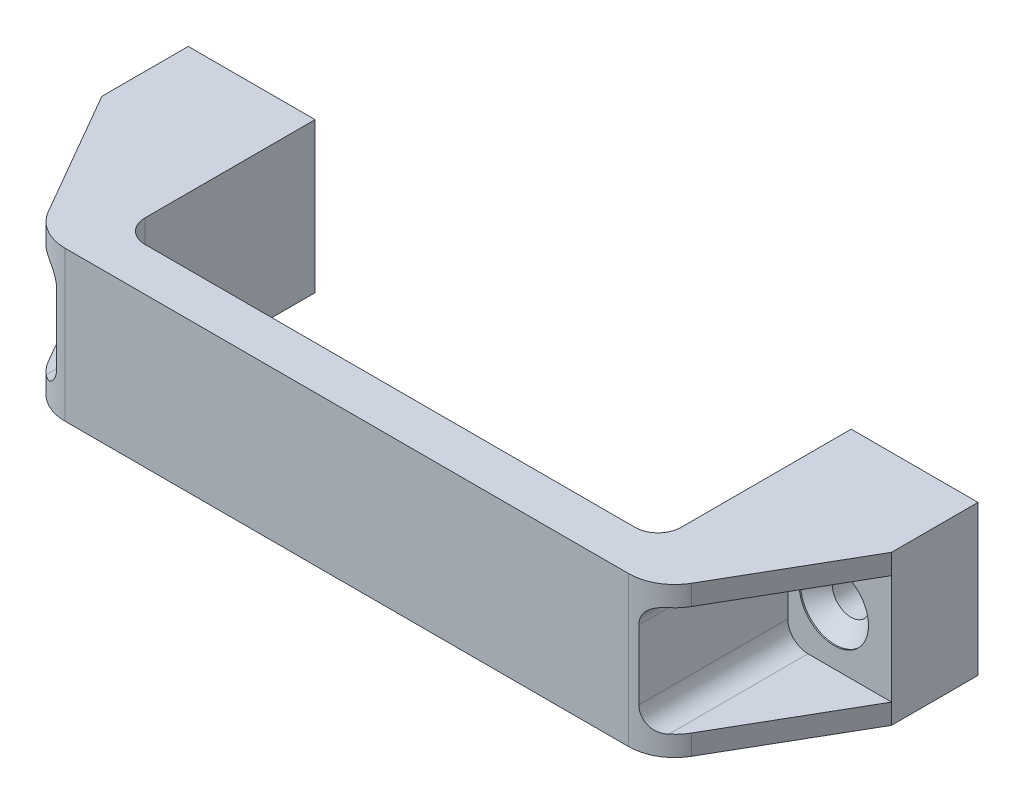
ISO-10303-21;
HEADER;
FILE_DESCRIPTION(('STEP AP214'),'2;1');
FILE_NAME('part.step','',(''),(''),'','','');
FILE_SCHEMA(('AUTOMOTIVE_DESIGN { 1 0 10303 214 1 1 1 1 }'));
ENDSEC;
DATA;
#1=APPLICATION_CONTEXT('core data for automotive mechanical design processes');
#2=APPLICATION_PROTOCOL_DEFINITION('international standard','automotive_design',2000,#1);
#3=PRODUCT_CONTEXT('',#1,'mechanical');
#4=PRODUCT('Part','Part','',(#3));
#5=PRODUCT_RELATED_PRODUCT_CATEGORY('part','',(#4));
#6=PRODUCT_DEFINITION_FORMATION('','',#4);
#7=PRODUCT_DEFINITION_CONTEXT('part definition',#1,'design');
#8=PRODUCT_DEFINITION('design','',#6,#7);
#9=PRODUCT_DEFINITION_SHAPE('','',#8);
#10=(LENGTH_UNIT() NAMED_UNIT(*) SI_UNIT(.MILLI.,.METRE.));
#11=(NAMED_UNIT(*) PLANE_ANGLE_UNIT() SI_UNIT($,.RADIAN.));
#12=(NAMED_UNIT(*) SI_UNIT($,.STERADIAN.) SOLID_ANGLE_UNIT());
#13=UNCERTAINTY_MEASURE_WITH_UNIT(LENGTH_MEASURE(1.E-05),#10,'distance_accuracy_value','');
#14=(GEOMETRIC_REPRESENTATION_CONTEXT(3) GLOBAL_UNCERTAINTY_ASSIGNED_CONTEXT((#13)) GLOBAL_UNIT_ASSIGNED_CONTEXT((#10,
#11,#12)) REPRESENTATION_CONTEXT('',''));
#15=CARTESIAN_POINT('',(0.,0.,0.));
#16=DIRECTION('',(0.,0.,1.));
#17=DIRECTION('',(1.,0.,0.));
#18=AXIS2_PLACEMENT_3D('',#15,#16,#17);
#19=CARTESIAN_POINT('',(0.,0.,14.7749999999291));
#20=DIRECTION('',(0.,0.,1.));
#21=DIRECTION('',(0.,-1.,0.));
#22=AXIS2_PLACEMENT_3D('',#19,#20,#21);
#23=CONICAL_SURFACE('',#22,5.99999999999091,0.785398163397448);
#24=CARTESIAN_POINT('',(0.,0.,12.025));
#25=DIRECTION('',(0.,0.,-1.));
#26=DIRECTION('',(0.,1.,0.));
#27=AXIS2_PLACEMENT_3D('',#24,#25,#26);
#28=CIRCLE('',#27,3.25);
#29=CARTESIAN_POINT('',(0.,3.25,12.025));
#30=VERTEX_POINT('',#29);
#31=EDGE_CURVE('E235',#30,#30,#28,.T.);
#32=ORIENTED_EDGE('',*,*,#31,.T.);
#33=EDGE_LOOP('',(#32));
#34=FACE_BOUND('',#33,.T.);
#35=CARTESIAN_POINT('',(0.,0.,14.775));
#36=DIRECTION('',(0.,0.,-1.));
#37=DIRECTION('',(0.,1.,0.));
#38=AXIS2_PLACEMENT_3D('',#35,#36,#37);
#39=CIRCLE('',#38,6.);
#40=CARTESIAN_POINT('',(0.,6.,14.775));
#41=VERTEX_POINT('',#40);
#42=EDGE_CURVE('E241',#41,#41,#39,.F.);
#43=ORIENTED_EDGE('',*,*,#42,.T.);
#44=EDGE_LOOP('',(#43));
#45=FACE_BOUND('',#44,.T.);
#46=ADVANCED_FACE('F14',(#34,#45),#23,.F.);
#47=CARTESIAN_POINT('',(117.,0.,14.7749999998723));
#48=DIRECTION('',(0.,0.,1.));
#49=DIRECTION('',(0.,-1.,0.));
#50=AXIS2_PLACEMENT_3D('',#47,#48,#49);
#51=CONICAL_SURFACE('',#50,5.9999999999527,0.785398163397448);
#52=CARTESIAN_POINT('',(117.,0.,12.025));
#53=DIRECTION('',(0.,0.,-1.));
#54=DIRECTION('',(0.,1.,0.));
#55=AXIS2_PLACEMENT_3D('',#52,#53,#54);
#56=CIRCLE('',#55,3.25);
#57=CARTESIAN_POINT('',(117.,3.25,12.025));
#58=VERTEX_POINT('',#57);
#59=EDGE_CURVE('E232',#58,#58,#56,.T.);
#60=ORIENTED_EDGE('',*,*,#59,.T.);
#61=EDGE_LOOP('',(#60));
#62=FACE_BOUND('',#61,.T.);
#63=CARTESIAN_POINT('',(117.,0.,14.775));
#64=DIRECTION('',(0.,0.,-1.));
#65=DIRECTION('',(0.,1.,0.));
#66=AXIS2_PLACEMENT_3D('',#63,#64,#65);
#67=CIRCLE('',#66,6.);
#68=CARTESIAN_POINT('',(117.,6.,14.775));
#69=VERTEX_POINT('',#68);
#70=EDGE_CURVE('E238',#69,#69,#67,.F.);
#71=ORIENTED_EDGE('',*,*,#70,.T.);
#72=EDGE_LOOP('',(#71));
#73=FACE_BOUND('',#72,.T.);
#74=ADVANCED_FACE('F347',(#62,#73),#51,.F.);
#75=CARTESIAN_POINT('',(0.,0.,14.8875));
#76=DIRECTION('',(0.,0.,-1.));
#77=DIRECTION('',(0.,1.,0.));
#78=AXIS2_PLACEMENT_3D('',#75,#76,#77);
#79=CYLINDRICAL_SURFACE('',#78,6.);
#80=ORIENTED_EDGE('',*,*,#42,.F.);
#81=EDGE_LOOP('',(#80));
#82=FACE_BOUND('',#81,.T.);
#83=CARTESIAN_POINT('',(0.,0.,14.999));
#84=DIRECTION('',(0.,0.,-1.));
#85=DIRECTION('',(0.,1.,0.));
#86=AXIS2_PLACEMENT_3D('',#83,#84,#85);
#87=CIRCLE('',#86,6.);
#88=CARTESIAN_POINT('',(0.,6.,14.999));
#89=VERTEX_POINT('',#88);
#90=EDGE_CURVE('E17',#89,#89,#87,.T.);
#91=ORIENTED_EDGE('',*,*,#90,.F.);
#92=EDGE_LOOP('',(#91));
#93=FACE_BOUND('',#92,.T.);
#94=ADVANCED_FACE('F344',(#82,#93),#79,.F.);
#95=CARTESIAN_POINT('',(117.,0.,14.8875));
#96=DIRECTION('',(0.,0.,-1.));
#97=DIRECTION('',(0.,1.,0.));
#98=AXIS2_PLACEMENT_3D('',#95,#96,#97);
#99=CYLINDRICAL_SURFACE('',#98,6.);
#100=ORIENTED_EDGE('',*,*,#70,.F.);
#101=EDGE_LOOP('',(#100));
#102=FACE_BOUND('',#101,.T.);
#103=CARTESIAN_POINT('',(117.,0.,14.999));
#104=DIRECTION('',(0.,0.,-1.));
#105=DIRECTION('',(0.,1.,0.));
#106=AXIS2_PLACEMENT_3D('',#103,#104,#105);
#107=CIRCLE('',#106,6.);
#108=CARTESIAN_POINT('',(117.,6.,14.999));
#109=VERTEX_POINT('',#108);
#110=EDGE_CURVE('E206',#109,#109,#107,.T.);
#111=ORIENTED_EDGE('',*,*,#110,.F.);
#112=EDGE_LOOP('',(#111));
#113=FACE_BOUND('',#112,.T.);
#114=ADVANCED_FACE('F340',(#102,#113),#99,.F.);
#115=CARTESIAN_POINT('',(0.,0.,6.0125));
#116=DIRECTION('',(0.,0.,-1.));
#117=DIRECTION('',(0.,1.,0.));
#118=AXIS2_PLACEMENT_3D('',#115,#116,#117);
#119=CYLINDRICAL_SURFACE('',#118,3.25);
#120=CARTESIAN_POINT('',(0.,0.,0.));
#121=DIRECTION('',(0.,0.,-1.));
#122=DIRECTION('',(0.,1.,0.));
#123=AXIS2_PLACEMENT_3D('',#120,#121,#122);
#124=CIRCLE('',#123,3.25);
#125=CARTESIAN_POINT('',(0.,3.25,0.));
#126=VERTEX_POINT('',#125);
#127=EDGE_CURVE('E465',#126,#126,#124,.F.);
#128=ORIENTED_EDGE('',*,*,#127,.F.);
#129=EDGE_LOOP('',(#128));
#130=FACE_BOUND('',#129,.T.);
#131=ORIENTED_EDGE('',*,*,#31,.F.);
#132=EDGE_LOOP('',(#131));
#133=FACE_BOUND('',#132,.T.);
#134=ADVANCED_FACE('F336',(#130,#133),#119,.F.);
#135=CARTESIAN_POINT('',(117.,0.,6.0125));
#136=DIRECTION('',(0.,0.,-1.));
#137=DIRECTION('',(0.,1.,0.));
#138=AXIS2_PLACEMENT_3D('',#135,#136,#137);
#139=CYLINDRICAL_SURFACE('',#138,3.25);
#140=CARTESIAN_POINT('',(117.,0.,0.));
#141=DIRECTION('',(0.,0.,-1.));
#142=DIRECTION('',(0.,1.,0.));
#143=AXIS2_PLACEMENT_3D('',#140,#141,#142);
#144=CIRCLE('',#143,3.25);
#145=CARTESIAN_POINT('',(117.,3.25,0.));
#146=VERTEX_POINT('',#145);
#147=EDGE_CURVE('E451',#146,#146,#144,.F.);
#148=ORIENTED_EDGE('',*,*,#147,.F.);
#149=EDGE_LOOP('',(#148));
#150=FACE_BOUND('',#149,.T.);
#151=ORIENTED_EDGE('',*,*,#59,.F.);
#152=EDGE_LOOP('',(#151));
#153=FACE_BOUND('',#152,.T.);
#154=ADVANCED_FACE('F333',(#150,#153),#139,.F.);
#155=CARTESIAN_POINT('',(58.5,0.,14.999));
#156=DIRECTION('',(0.,0.,1.));
#157=DIRECTION('',(0.,-1.,0.));
#158=AXIS2_PLACEMENT_3D('',#155,#156,#157);
#159=PLANE('',#158);
#160=CARTESIAN_POINT('',(4.5,6.,14.999));
#161=DIRECTION('',(0.,0.,-1.));
#162=DIRECTION('',(0.,1.,0.));
#163=AXIS2_PLACEMENT_3D('',#160,#161,#162);
#164=CIRCLE('',#163,3.5);
#165=CARTESIAN_POINT('',(8.,6.,14.999));
#166=VERTEX_POINT('',#165);
#167=CARTESIAN_POINT('',(4.5,9.5,14.999));
#168=VERTEX_POINT('',#167);
#169=EDGE_CURVE('E162',#166,#168,#164,.F.);
#170=ORIENTED_EDGE('',*,*,#169,.T.);
#171=DIRECTION('',(-1.,0.,0.));
#172=VECTOR('',#171,1.);
#173=CARTESIAN_POINT('',(-12.,9.5,14.999));
#174=LINE('',#173,#172);
#175=CARTESIAN_POINT('',(-10.,9.5,14.999));
#176=VERTEX_POINT('',#175);
#177=EDGE_CURVE('E167',#168,#176,#174,.T.);
#178=ORIENTED_EDGE('',*,*,#177,.T.);
#179=DIRECTION('',(0.,-1.,0.));
#180=VECTOR('',#179,1.);
#181=CARTESIAN_POINT('',(-10.,-13.,14.999));
#182=LINE('',#181,#180);
#183=CARTESIAN_POINT('',(-10.,-9.5,14.999));
#184=VERTEX_POINT('',#183);
#185=EDGE_CURVE('E425',#184,#176,#182,.F.);
#186=ORIENTED_EDGE('',*,*,#185,.F.);
#187=DIRECTION('',(1.,0.,0.));
#188=VECTOR('',#187,1.);
#189=CARTESIAN_POINT('',(4.5,-9.5,14.999));
#190=LINE('',#189,#188);
#191=CARTESIAN_POINT('',(4.5,-9.5,14.999));
#192=VERTEX_POINT('',#191);
#193=EDGE_CURVE('E194',#184,#192,#190,.T.);
#194=ORIENTED_EDGE('',*,*,#193,.T.);
#195=CARTESIAN_POINT('',(4.5,-6.,14.999));
#196=DIRECTION('',(0.,0.,-1.));
#197=DIRECTION('',(0.,1.,0.));
#198=AXIS2_PLACEMENT_3D('',#195,#196,#197);
#199=CIRCLE('',#198,3.5);
#200=CARTESIAN_POINT('',(8.,-6.,14.999));
#201=VERTEX_POINT('',#200);
#202=EDGE_CURVE('E472',#192,#201,#199,.F.);
#203=ORIENTED_EDGE('',*,*,#202,.T.);
#204=DIRECTION('',(0.,1.,0.));
#205=VECTOR('',#204,1.);
#206=CARTESIAN_POINT('',(8.,6.,14.999));
#207=LINE('',#206,#205);
#208=EDGE_CURVE('E160',#201,#166,#207,.T.);
#209=ORIENTED_EDGE('',*,*,#208,.T.);
#210=EDGE_LOOP('',(#170,#178,#186,#194,#203,#209));
#211=FACE_BOUND('',#210,.T.);
#212=ORIENTED_EDGE('',*,*,#90,.T.);
#213=EDGE_LOOP('',(#212));
#214=FACE_BOUND('',#213,.T.);
#215=ADVANCED_FACE('F164',(#211,#214),#159,.T.);
#216=CARTESIAN_POINT('',(58.5,0.,14.999));
#217=DIRECTION('',(0.,0.,1.));
#218=DIRECTION('',(0.,-1.,0.));
#219=AXIS2_PLACEMENT_3D('',#216,#217,#218);
#220=PLANE('',#219);
#221=CARTESIAN_POINT('',(112.5,-6.,14.999));
#222=DIRECTION('',(0.,0.,-1.));
#223=DIRECTION('',(0.,1.,0.));
#224=AXIS2_PLACEMENT_3D('',#221,#222,#223);
#225=CIRCLE('',#224,3.5);
#226=CARTESIAN_POINT('',(109.,-6.,14.999));
#227=VERTEX_POINT('',#226);
#228=CARTESIAN_POINT('',(112.5,-9.5,14.999));
#229=VERTEX_POINT('',#228);
#230=EDGE_CURVE('E397',#227,#229,#225,.F.);
#231=ORIENTED_EDGE('',*,*,#230,.T.);
#232=DIRECTION('',(1.,0.,0.));
#233=VECTOR('',#232,1.);
#234=CARTESIAN_POINT('',(129.,-9.5,14.999));
#235=LINE('',#234,#233);
#236=CARTESIAN_POINT('',(127.,-9.5,14.999));
#237=VERTEX_POINT('',#236);
#238=EDGE_CURVE('E402',#229,#237,#235,.T.);
#239=ORIENTED_EDGE('',*,*,#238,.T.);
#240=DIRECTION('',(0.,1.,0.));
#241=VECTOR('',#240,1.);
#242=CARTESIAN_POINT('',(127.,-13.,14.999));
#243=LINE('',#242,#241);
#244=CARTESIAN_POINT('',(127.,9.5,14.999));
#245=VERTEX_POINT('',#244);
#246=EDGE_CURVE('E440',#245,#237,#243,.F.);
#247=ORIENTED_EDGE('',*,*,#246,.F.);
#248=DIRECTION('',(-1.,0.,0.));
#249=VECTOR('',#248,1.);
#250=CARTESIAN_POINT('',(112.5,9.5,14.999));
#251=LINE('',#250,#249);
#252=CARTESIAN_POINT('',(112.5,9.5,14.999));
#253=VERTEX_POINT('',#252);
#254=EDGE_CURVE('E415',#245,#253,#251,.T.);
#255=ORIENTED_EDGE('',*,*,#254,.T.);
#256=CARTESIAN_POINT('',(112.5,6.,14.999));
#257=DIRECTION('',(0.,0.,-1.));
#258=DIRECTION('',(0.,1.,0.));
#259=AXIS2_PLACEMENT_3D('',#256,#257,#258);
#260=CIRCLE('',#259,3.5);
#261=CARTESIAN_POINT('',(109.,6.,14.999));
#262=VERTEX_POINT('',#261);
#263=EDGE_CURVE('E389',#253,#262,#260,.F.);
#264=ORIENTED_EDGE('',*,*,#263,.T.);
#265=DIRECTION('',(0.,-1.,0.));
#266=VECTOR('',#265,1.);
#267=CARTESIAN_POINT('',(109.,-6.,14.999));
#268=LINE('',#267,#266);
#269=EDGE_CURVE('E228',#262,#227,#268,.T.);
#270=ORIENTED_EDGE('',*,*,#269,.T.);
#271=EDGE_LOOP('',(#231,#239,#247,#255,#264,#270));
#272=FACE_BOUND('',#271,.T.);
#273=ORIENTED_EDGE('',*,*,#110,.T.);
#274=EDGE_LOOP('',(#273));
#275=FACE_BOUND('',#274,.T.);
#276=ADVANCED_FACE('F326',(#272,#275),#220,.T.);
#277=CARTESIAN_POINT('',(4.5,-9.5,14.999));
#278=DIRECTION('',(0.,-1.,0.));
#279=DIRECTION('',(1.,0.,0.));
#280=AXIS2_PLACEMENT_3D('',#277,#278,#279);
#281=PLANE('',#280);
#282=DIRECTION('',(0.,0.,-1.));
#283=VECTOR('',#282,1.);
#284=CARTESIAN_POINT('',(4.5,-9.5,14.999));
#285=LINE('',#284,#283);
#286=CARTESIAN_POINT('',(4.5,-9.5,39.1387321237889));
#287=VERTEX_POINT('',#286);
#288=EDGE_CURVE('E473',#287,#192,#285,.T.);
#289=ORIENTED_EDGE('',*,*,#288,.T.);
#290=ORIENTED_EDGE('',*,*,#193,.F.);
#291=DIRECTION('',(0.,0.,1.));
#292=VECTOR('',#291,1.);
#293=CARTESIAN_POINT('',(-10.,-9.5,15.));
#294=LINE('',#293,#292);
#295=CARTESIAN_POINT('',(-10.,-9.5,15.));
#296=VERTEX_POINT('',#295);
#297=EDGE_CURVE('E203',#296,#184,#294,.F.);
#298=ORIENTED_EDGE('',*,*,#297,.F.);
#299=DIRECTION('',(-0.5,0.,-0.866025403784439));
#300=VECTOR('',#299,1.);
#301=CARTESIAN_POINT('',(2.7017059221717,-9.5,37.));
#302=LINE('',#301,#300);
#303=CARTESIAN_POINT('',(2.70170592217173,-9.5,37.));
#304=VERTEX_POINT('',#303);
#305=EDGE_CURVE('E200',#304,#296,#302,.T.);
#306=ORIENTED_EDGE('',*,*,#305,.F.);
#307=CARTESIAN_POINT('',(9.6299091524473,-9.5,33.));
#308=DIRECTION('',(0.,-1.,0.));
#309=DIRECTION('',(1.,0.,0.));
#310=AXIS2_PLACEMENT_3D('',#307,#308,#309);
#311=CIRCLE('',#310,8.);
#312=EDGE_CURVE('E376',#287,#304,#311,.T.);
#313=ORIENTED_EDGE('',*,*,#312,.F.);
#314=EDGE_LOOP('',(#289,#290,#298,#306,#313));
#315=FACE_BOUND('',#314,.T.);
#316=ADVANCED_FACE('F322',(#315),#281,.F.);
#317=CARTESIAN_POINT('',(2.7017059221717,-13.,37.));
#318=DIRECTION('',(-0.866025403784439,0.,0.5));
#319=DIRECTION('',(-0.5,0.,-0.866025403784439));
#320=AXIS2_PLACEMENT_3D('',#317,#318,#319);
#321=PLANE('',#320);
#322=DIRECTION('',(-0.5,0.,-0.86602540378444));
#323=VECTOR('',#322,1.);
#324=CARTESIAN_POINT('',(2.7017059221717,13.,37.));
#325=LINE('',#324,#323);
#326=CARTESIAN_POINT('',(2.70170592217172,13.,37.));
#327=VERTEX_POINT('',#326);
#328=CARTESIAN_POINT('',(-10.,13.,15.));
#329=VERTEX_POINT('',#328);
#330=EDGE_CURVE('E214',#327,#329,#325,.T.);
#331=ORIENTED_EDGE('',*,*,#330,.T.);
#332=DIRECTION('',(0.,-1.,0.));
#333=VECTOR('',#332,1.);
#334=CARTESIAN_POINT('',(-10.,-13.,15.));
#335=LINE('',#334,#333);
#336=CARTESIAN_POINT('',(-10.,9.5,15.));
#337=VERTEX_POINT('',#336);
#338=EDGE_CURVE('E422',#337,#329,#335,.F.);
#339=ORIENTED_EDGE('',*,*,#338,.F.);
#340=DIRECTION('',(0.5,0.,0.86602540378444));
#341=VECTOR('',#340,1.);
#342=CARTESIAN_POINT('',(-10.,9.5,15.));
#343=LINE('',#342,#341);
#344=CARTESIAN_POINT('',(2.70170592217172,9.5,37.));
#345=VERTEX_POINT('',#344);
#346=EDGE_CURVE('E181',#337,#345,#343,.T.);
#347=ORIENTED_EDGE('',*,*,#346,.T.);
#348=DIRECTION('',(0.,-1.,0.));
#349=VECTOR('',#348,1.);
#350=CARTESIAN_POINT('',(2.70170592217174,-13.,37.));
#351=LINE('',#350,#349);
#352=EDGE_CURVE('E195',#327,#345,#351,.T.);
#353=ORIENTED_EDGE('',*,*,#352,.F.);
#354=EDGE_LOOP('',(#331,#339,#347,#353));
#355=FACE_BOUND('',#354,.T.);
#356=ADVANCED_FACE('F319',(#355),#321,.T.);
#357=CARTESIAN_POINT('',(-12.,9.5,14.999));
#358=DIRECTION('',(0.,1.,0.));
#359=DIRECTION('',(-1.,0.,0.));
#360=AXIS2_PLACEMENT_3D('',#357,#358,#359);
#361=PLANE('',#360);
#362=ORIENTED_EDGE('',*,*,#177,.F.);
#363=DIRECTION('',(0.,0.,-1.));
#364=VECTOR('',#363,1.);
#365=CARTESIAN_POINT('',(4.5,9.5,14.999));
#366=LINE('',#365,#364);
#367=CARTESIAN_POINT('',(4.5,9.5,39.1387321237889));
#368=VERTEX_POINT('',#367);
#369=EDGE_CURVE('E172',#168,#368,#366,.F.);
#370=ORIENTED_EDGE('',*,*,#369,.T.);
#371=CARTESIAN_POINT('',(9.6299091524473,9.5,33.));
#372=DIRECTION('',(0.,-1.,0.));
#373=DIRECTION('',(1.,0.,0.));
#374=AXIS2_PLACEMENT_3D('',#371,#372,#373);
#375=CIRCLE('',#374,8.);
#376=EDGE_CURVE('E198',#345,#368,#375,.F.);
#377=ORIENTED_EDGE('',*,*,#376,.F.);
#378=ORIENTED_EDGE('',*,*,#346,.F.);
#379=DIRECTION('',(0.,0.,1.));
#380=VECTOR('',#379,1.);
#381=CARTESIAN_POINT('',(-10.,9.5,15.));
#382=LINE('',#381,#380);
#383=EDGE_CURVE('E179',#176,#337,#382,.T.);
#384=ORIENTED_EDGE('',*,*,#383,.F.);
#385=EDGE_LOOP('',(#362,#370,#377,#378,#384));
#386=FACE_BOUND('',#385,.T.);
#387=ADVANCED_FACE('F175',(#386),#361,.F.);
#388=CARTESIAN_POINT('',(4.5,6.,14.999));
#389=DIRECTION('',(0.,0.,-1.));
#390=DIRECTION('',(0.,1.,0.));
#391=AXIS2_PLACEMENT_3D('',#388,#389,#390);
#392=CYLINDRICAL_SURFACE('',#391,3.5);
#393=ORIENTED_EDGE('',*,*,#369,.F.);
#394=ORIENTED_EDGE('',*,*,#169,.F.);
#395=DIRECTION('',(0.,0.,1.));
#396=VECTOR('',#395,1.);
#397=CARTESIAN_POINT('',(8.,6.,14.999));
#398=LINE('',#397,#396);
#399=CARTESIAN_POINT('',(8.,6.,40.832202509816));
#400=VERTEX_POINT('',#399);
#401=EDGE_CURVE('E188',#166,#400,#398,.T.);
#402=ORIENTED_EDGE('',*,*,#401,.T.);
#403=CARTESIAN_POINT('',(4.5,9.5,39.1387321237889));
#404=CARTESIAN_POINT('',(4.58708588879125,9.50000495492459,39.2115294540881));
#405=CARTESIAN_POINT('',(4.67577777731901,9.49674876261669,39.2824756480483));
#406=CARTESIAN_POINT('',(4.85582931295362,9.48303589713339,39.420354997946));
#407=CARTESIAN_POINT('',(4.94719168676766,9.4725715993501,39.4872838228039));
#408=CARTESIAN_POINT('',(5.13240901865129,9.44367468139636,39.6170515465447));
#409=CARTESIAN_POINT('',(5.22627567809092,9.42519443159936,39.6798633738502));
#410=CARTESIAN_POINT('',(5.41506152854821,9.37965767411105,39.8005588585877));
#411=CARTESIAN_POINT('',(5.50998035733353,9.35260403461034,39.8584441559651));
#412=CARTESIAN_POINT('',(5.70055149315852,9.28919914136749,39.9693896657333));
#413=CARTESIAN_POINT('',(5.79620412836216,9.25278189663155,40.0224118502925));
#414=CARTESIAN_POINT('',(5.98631653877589,9.17042436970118,40.122906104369));
#415=CARTESIAN_POINT('',(6.08077646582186,9.12448531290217,40.1703788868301));
#416=CARTESIAN_POINT('',(6.2668578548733,9.02314387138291,40.25951067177));
#417=CARTESIAN_POINT('',(6.35848782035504,8.96777394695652,40.3011887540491));
#418=CARTESIAN_POINT('',(6.53784798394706,8.84759941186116,40.3789369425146));
#419=CARTESIAN_POINT('',(6.62557888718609,8.78279651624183,40.4150080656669));
#420=CARTESIAN_POINT('',(6.78392307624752,8.65379473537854,40.4770689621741));
#421=CARTESIAN_POINT('',(6.85521890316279,8.59076815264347,40.5037631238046));
#422=CARTESIAN_POINT('',(6.99312266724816,8.45834899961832,40.5533255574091));
#423=CARTESIAN_POINT('',(7.05972911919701,8.38895442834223,40.5761926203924));
#424=CARTESIAN_POINT('',(7.18749885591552,8.24425165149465,40.6183438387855));
#425=CARTESIAN_POINT('',(7.24865983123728,8.16894096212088,40.6376264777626));
#426=CARTESIAN_POINT('',(7.36484738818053,8.01298882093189,40.6728860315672));
#427=CARTESIAN_POINT('',(7.4198717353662,7.93234544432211,40.6888617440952));
#428=CARTESIAN_POINT('',(7.56970580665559,7.69155092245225,40.7308467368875));
#429=CARTESIAN_POINT('',(7.65577718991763,7.52513673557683,40.752953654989));
#430=CARTESIAN_POINT('',(7.80037290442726,7.18006675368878,40.7883496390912));
#431=CARTESIAN_POINT('',(7.85891375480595,7.00141837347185,40.8016439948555));
#432=CARTESIAN_POINT('',(7.93504985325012,6.68515211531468,40.8184719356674));
#433=CARTESIAN_POINT('',(7.95938635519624,6.54921594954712,40.8236589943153));
#434=CARTESIAN_POINT('',(7.98374137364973,6.34393885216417,40.828805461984));
#435=CARTESIAN_POINT('',(7.98983474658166,6.27531119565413,40.8300819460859));
#436=CARTESIAN_POINT('',(7.99796494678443,6.13779344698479,40.8317791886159));
#437=CARTESIAN_POINT('',(8.00000106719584,6.06890331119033,40.8321997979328));
#438=CARTESIAN_POINT('',(8.,6.,40.832202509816));
#439=B_SPLINE_CURVE_WITH_KNOTS('',3,(#403,#404,#405,#406,#407,#408,#409,#410,#411,#412,#413,
#414,#415,#416,#417,#418,#419,#420,#421,#422,#423,#424,#425,#426,#427,#428,#429,#430,#431,#432,
#433,#434,#435,#436,#437,#438),.UNSPECIFIED.,.F.,.F.,(4,2,2,2,2,2,2,2,2,2,2,2,2,2,2,2,2,4),(0.,
0.340509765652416,0.681380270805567,1.02430453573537,1.36711419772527,1.71240943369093,
2.05766025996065,2.40174592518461,2.74576910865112,3.04189009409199,3.33810444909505,
3.63444383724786,3.93089077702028,4.49401714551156,5.05680518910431,5.47035782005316,
5.67697411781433,5.88362640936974),.UNSPECIFIED.);
#440=EDGE_CURVE('E185',#368,#400,#439,.T.);
#441=ORIENTED_EDGE('',*,*,#440,.F.);
#442=EDGE_LOOP('',(#393,#394,#402,#441));
#443=FACE_BOUND('',#442,.T.);
#444=ADVANCED_FACE('F183',(#443),#392,.F.);
#445=CARTESIAN_POINT('',(8.,6.,14.999));
#446=DIRECTION('',(1.,0.,0.));
#447=DIRECTION('',(0.,1.,0.));
#448=AXIS2_PLACEMENT_3D('',#445,#446,#447);
#449=PLANE('',#448);
#450=ORIENTED_EDGE('',*,*,#401,.F.);
#451=ORIENTED_EDGE('',*,*,#208,.F.);
#452=DIRECTION('',(0.,0.,-1.));
#453=VECTOR('',#452,1.);
#454=CARTESIAN_POINT('',(8.,-6.,14.999));
#455=LINE('',#454,#453);
#456=CARTESIAN_POINT('',(8.,-6.,40.832202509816));
#457=VERTEX_POINT('',#456);
#458=EDGE_CURVE('E471',#201,#457,#455,.F.);
#459=ORIENTED_EDGE('',*,*,#458,.T.);
#460=DIRECTION('',(0.,-1.,0.));
#461=VECTOR('',#460,1.);
#462=CARTESIAN_POINT('',(8.,-13.,40.832202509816));
#463=LINE('',#462,#461);
#464=EDGE_CURVE('E300',#400,#457,#463,.T.);
#465=ORIENTED_EDGE('',*,*,#464,.F.);
#466=EDGE_LOOP('',(#450,#451,#459,#465));
#467=FACE_BOUND('',#466,.T.);
#468=ADVANCED_FACE('F309',(#467),#449,.F.);
#469=CARTESIAN_POINT('',(4.5,-6.,14.999));
#470=DIRECTION('',(0.,0.,-1.));
#471=DIRECTION('',(0.,1.,0.));
#472=AXIS2_PLACEMENT_3D('',#469,#470,#471);
#473=CYLINDRICAL_SURFACE('',#472,3.5);
#474=ORIENTED_EDGE('',*,*,#458,.F.);
#475=ORIENTED_EDGE('',*,*,#202,.F.);
#476=ORIENTED_EDGE('',*,*,#288,.F.);
#477=CARTESIAN_POINT('',(8.,-6.,40.832202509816));
#478=CARTESIAN_POINT('',(8.00001011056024,-6.09578803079,40.8321916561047));
#479=CARTESIAN_POINT('',(7.99606774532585,-6.19157248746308,40.8313838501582));
#480=CARTESIAN_POINT('',(7.98035522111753,-6.38246809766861,40.8280961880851));
#481=CARTESIAN_POINT('',(7.96858508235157,-6.47757925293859,40.825616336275));
#482=CARTESIAN_POINT('',(7.93729814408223,-6.66643860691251,40.8189072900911));
#483=CARTESIAN_POINT('',(7.91778331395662,-6.76018714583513,40.8146785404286));
#484=CARTESIAN_POINT('',(7.87118750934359,-6.94564847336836,40.8043232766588));
#485=CARTESIAN_POINT('',(7.84410670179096,-7.03736130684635,40.7981968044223));
#486=CARTESIAN_POINT('',(7.75175934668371,-7.30861032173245,40.7766715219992));
#487=CARTESIAN_POINT('',(7.67538454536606,-7.48427689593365,40.7581262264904));
#488=CARTESIAN_POINT('',(7.49584954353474,-7.81964044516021,40.7106642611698));
#489=CARTESIAN_POINT('',(7.3926979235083,-7.97934251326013,40.6817509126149));
#490=CARTESIAN_POINT('',(7.16475747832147,-8.27679349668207,40.6116393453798));
#491=CARTESIAN_POINT('',(7.04020113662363,-8.41475054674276,40.5705700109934));
#492=CARTESIAN_POINT('',(6.77397337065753,-8.66695426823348,40.4741953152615));
#493=CARTESIAN_POINT('',(6.63231332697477,-8.78121656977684,40.4188993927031));
#494=CARTESIAN_POINT('',(6.33923739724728,-8.98305156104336,40.2936018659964));
#495=CARTESIAN_POINT('',(6.1879233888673,-9.07086039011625,40.2237404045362));
#496=CARTESIAN_POINT('',(5.8800632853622,-9.22099608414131,40.0688296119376));
#497=CARTESIAN_POINT('',(5.72350688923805,-9.28326915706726,39.9837487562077));
#498=CARTESIAN_POINT('',(5.47564820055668,-9.36265044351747,39.8376548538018));
#499=CARTESIAN_POINT('',(5.3840932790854,-9.38779050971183,39.7812093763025));
#500=CARTESIAN_POINT('',(5.20201322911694,-9.43014657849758,39.6637422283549));
#501=CARTESIAN_POINT('',(5.11148859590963,-9.44735891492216,39.6027184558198));
#502=CARTESIAN_POINT('',(4.93262757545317,-9.4743331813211,39.4766865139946));
#503=CARTESIAN_POINT('',(4.84428468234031,-9.48412076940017,39.4116929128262));
#504=CARTESIAN_POINT('',(4.67012998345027,-9.4969520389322,39.2779527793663));
#505=CARTESIAN_POINT('',(4.58431548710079,-9.50000316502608,39.2092104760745));
#506=CARTESIAN_POINT('',(4.5,-9.5,39.1387321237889));
#507=B_SPLINE_CURVE_WITH_KNOTS('',3,(#477,#478,#479,#480,#481,#482,#483,#484,#485,#486,#487,
#488,#489,#490,#491,#492,#493,#494,#495,#496,#497,#498,#499,#500,#501,#502,#503,#504,#505,#506),
.UNSPECIFIED.,.F.,.F.,(4,2,2,2,2,2,2,2,2,2,2,2,2,2,4),(0.,0.287272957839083,0.574545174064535,
0.861744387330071,1.14893726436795,1.72326329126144,2.29740550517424,2.86566603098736,
3.43355050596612,3.99620429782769,4.56003732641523,4.89106323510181,5.22224207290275,
5.55227115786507,5.88193533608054),.UNSPECIFIED.);
#508=EDGE_CURVE('E291',#457,#287,#507,.T.);
#509=ORIENTED_EDGE('',*,*,#508,.F.);
#510=EDGE_LOOP('',(#474,#475,#476,#509));
#511=FACE_BOUND('',#510,.T.);
#512=ADVANCED_FACE('F303',(#511),#473,.F.);
#513=CARTESIAN_POINT('',(-10.,-13.,0.));
#514=DIRECTION('',(0.,0.,-1.));
#515=DIRECTION('',(0.,1.,0.));
#516=AXIS2_PLACEMENT_3D('',#513,#514,#515);
#517=PLANE('',#516);
#518=DIRECTION('',(1.,0.,0.));
#519=VECTOR('',#518,1.);
#520=CARTESIAN_POINT('',(58.5,-13.,0.));
#521=LINE('',#520,#519);
#522=CARTESIAN_POINT('',(-10.,-13.,0.));
#523=VERTEX_POINT('',#522);
#524=CARTESIAN_POINT('',(12.,-13.,0.));
#525=VERTEX_POINT('',#524);
#526=EDGE_CURVE('E299',#523,#525,#521,.T.);
#527=ORIENTED_EDGE('',*,*,#526,.F.);
#528=DIRECTION('',(0.,-1.,0.));
#529=VECTOR('',#528,1.);
#530=CARTESIAN_POINT('',(-10.,-13.,0.));
#531=LINE('',#530,#529);
#532=CARTESIAN_POINT('',(-10.,13.,0.));
#533=VERTEX_POINT('',#532);
#534=EDGE_CURVE('E421',#533,#523,#531,.T.);
#535=ORIENTED_EDGE('',*,*,#534,.F.);
#536=DIRECTION('',(1.,0.,0.));
#537=VECTOR('',#536,1.);
#538=CARTESIAN_POINT('',(58.5,13.,0.));
#539=LINE('',#538,#537);
#540=CARTESIAN_POINT('',(12.,13.,0.));
#541=VERTEX_POINT('',#540);
#542=EDGE_CURVE('E207',#533,#541,#539,.T.);
#543=ORIENTED_EDGE('',*,*,#542,.T.);
#544=DIRECTION('',(0.,1.,0.));
#545=VECTOR('',#544,1.);
#546=CARTESIAN_POINT('',(12.,-13.,0.));
#547=LINE('',#546,#545);
#548=EDGE_CURVE('E462',#525,#541,#547,.T.);
#549=ORIENTED_EDGE('',*,*,#548,.F.);
#550=EDGE_LOOP('',(#527,#535,#543,#549));
#551=FACE_BOUND('',#550,.T.);
#552=ORIENTED_EDGE('',*,*,#127,.T.);
#553=EDGE_LOOP('',(#552));
#554=FACE_BOUND('',#553,.T.);
#555=ADVANCED_FACE('F308',(#551,#554),#517,.T.);
#556=CARTESIAN_POINT('',(12.,-13.,0.));
#557=DIRECTION('',(1.,0.,0.));
#558=DIRECTION('',(0.,1.,0.));
#559=AXIS2_PLACEMENT_3D('',#556,#557,#558);
#560=PLANE('',#559);
#561=DIRECTION('',(0.,0.,1.));
#562=VECTOR('',#561,1.);
#563=CARTESIAN_POINT('',(12.,-13.,0.));
#564=LINE('',#563,#562);
#565=CARTESIAN_POINT('',(12.,-13.,29.5));
#566=VERTEX_POINT('',#565);
#567=EDGE_CURVE('E468',#525,#566,#564,.T.);
#568=ORIENTED_EDGE('',*,*,#567,.F.);
#569=ORIENTED_EDGE('',*,*,#548,.T.);
#570=DIRECTION('',(0.,0.,1.));
#571=VECTOR('',#570,1.);
#572=CARTESIAN_POINT('',(12.,13.,0.));
#573=LINE('',#572,#571);
#574=CARTESIAN_POINT('',(12.,13.,29.5));
#575=VERTEX_POINT('',#574);
#576=EDGE_CURVE('E210',#541,#575,#573,.T.);
#577=ORIENTED_EDGE('',*,*,#576,.T.);
#578=DIRECTION('',(0.,-1.,0.));
#579=VECTOR('',#578,1.);
#580=CARTESIAN_POINT('',(12.,-13.,29.5));
#581=LINE('',#580,#579);
#582=EDGE_CURVE('E460',#575,#566,#581,.T.);
#583=ORIENTED_EDGE('',*,*,#582,.T.);
#584=EDGE_LOOP('',(#568,#569,#577,#583));
#585=FACE_BOUND('',#584,.T.);
#586=ADVANCED_FACE('F513',(#585),#560,.T.);
#587=CARTESIAN_POINT('',(16.,-13.,29.5));
#588=DIRECTION('',(0.,-1.,0.));
#589=DIRECTION('',(1.,0.,0.));
#590=AXIS2_PLACEMENT_3D('',#587,#588,#589);
#591=CYLINDRICAL_SURFACE('',#590,4.);
#592=DIRECTION('',(0.,1.,0.));
#593=VECTOR('',#592,1.);
#594=CARTESIAN_POINT('',(16.,-13.,33.5));
#595=LINE('',#594,#593);
#596=CARTESIAN_POINT('',(16.,-13.,33.5));
#597=VERTEX_POINT('',#596);
#598=CARTESIAN_POINT('',(16.,13.,33.5));
#599=VERTEX_POINT('',#598);
#600=EDGE_CURVE('E457',#597,#599,#595,.T.);
#601=ORIENTED_EDGE('',*,*,#600,.F.);
#602=CARTESIAN_POINT('',(16.,-13.,29.5));
#603=DIRECTION('',(0.,-1.,0.));
#604=DIRECTION('',(1.,0.,0.));
#605=AXIS2_PLACEMENT_3D('',#602,#603,#604);
#606=CIRCLE('',#605,4.);
#607=EDGE_CURVE('E301',#566,#597,#606,.F.);
#608=ORIENTED_EDGE('',*,*,#607,.F.);
#609=ORIENTED_EDGE('',*,*,#582,.F.);
#610=CARTESIAN_POINT('',(16.,13.,29.5));
#611=DIRECTION('',(0.,-1.,0.));
#612=DIRECTION('',(1.,0.,0.));
#613=AXIS2_PLACEMENT_3D('',#610,#611,#612);
#614=CIRCLE('',#613,4.);
#615=EDGE_CURVE('E385',#575,#599,#614,.F.);
#616=ORIENTED_EDGE('',*,*,#615,.T.);
#617=EDGE_LOOP('',(#601,#608,#609,#616));
#618=FACE_BOUND('',#617,.T.);
#619=ADVANCED_FACE('F518',(#618),#591,.F.);
#620=CARTESIAN_POINT('',(16.,-13.,33.5));
#621=DIRECTION('',(0.,0.,-1.));
#622=DIRECTION('',(0.,1.,0.));
#623=AXIS2_PLACEMENT_3D('',#620,#621,#622);
#624=PLANE('',#623);
#625=DIRECTION('',(1.,0.,0.));
#626=VECTOR('',#625,1.);
#627=CARTESIAN_POINT('',(58.5,-13.,33.5));
#628=LINE('',#627,#626);
#629=CARTESIAN_POINT('',(101.,-13.,33.5));
#630=VERTEX_POINT('',#629);
#631=EDGE_CURVE('E547',#597,#630,#628,.T.);
#632=ORIENTED_EDGE('',*,*,#631,.F.);
#633=ORIENTED_EDGE('',*,*,#600,.T.);
#634=DIRECTION('',(1.,0.,0.));
#635=VECTOR('',#634,1.);
#636=CARTESIAN_POINT('',(58.5,13.,33.5));
#637=LINE('',#636,#635);
#638=CARTESIAN_POINT('',(101.,13.,33.5));
#639=VERTEX_POINT('',#638);
#640=EDGE_CURVE('E383',#599,#639,#637,.T.);
#641=ORIENTED_EDGE('',*,*,#640,.T.);
#642=DIRECTION('',(0.,-1.,0.));
#643=VECTOR('',#642,1.);
#644=CARTESIAN_POINT('',(101.,-13.,33.5));
#645=LINE('',#644,#643);
#646=EDGE_CURVE('E455',#639,#630,#645,.T.);
#647=ORIENTED_EDGE('',*,*,#646,.T.);
#648=EDGE_LOOP('',(#632,#633,#641,#647));
#649=FACE_BOUND('',#648,.T.);
#650=ADVANCED_FACE('F557',(#649),#624,.T.);
#651=CARTESIAN_POINT('',(101.,-13.,29.5));
#652=DIRECTION('',(0.,-1.,0.));
#653=DIRECTION('',(1.,0.,0.));
#654=AXIS2_PLACEMENT_3D('',#651,#652,#653);
#655=CYLINDRICAL_SURFACE('',#654,4.);
#656=DIRECTION('',(0.,-1.,0.));
#657=VECTOR('',#656,1.);
#658=CARTESIAN_POINT('',(105.,-13.,29.5));
#659=LINE('',#658,#657);
#660=CARTESIAN_POINT('',(105.,-13.,29.5));
#661=VERTEX_POINT('',#660);
#662=CARTESIAN_POINT('',(105.,13.,29.5));
#663=VERTEX_POINT('',#662);
#664=EDGE_CURVE('E452',#661,#663,#659,.F.);
#665=ORIENTED_EDGE('',*,*,#664,.F.);
#666=CARTESIAN_POINT('',(101.,-13.,29.5));
#667=DIRECTION('',(0.,-1.,0.));
#668=DIRECTION('',(1.,0.,0.));
#669=AXIS2_PLACEMENT_3D('',#666,#667,#668);
#670=CIRCLE('',#669,4.);
#671=EDGE_CURVE('E546',#630,#661,#670,.F.);
#672=ORIENTED_EDGE('',*,*,#671,.F.);
#673=ORIENTED_EDGE('',*,*,#646,.F.);
#674=CARTESIAN_POINT('',(101.,13.,29.5));
#675=DIRECTION('',(0.,-1.,0.));
#676=DIRECTION('',(1.,0.,0.));
#677=AXIS2_PLACEMENT_3D('',#674,#675,#676);
#678=CIRCLE('',#677,4.);
#679=EDGE_CURVE('E382',#639,#663,#678,.F.);
#680=ORIENTED_EDGE('',*,*,#679,.T.);
#681=EDGE_LOOP('',(#665,#672,#673,#680));
#682=FACE_BOUND('',#681,.T.);
#683=ADVANCED_FACE('F562',(#682),#655,.F.);
#684=CARTESIAN_POINT('',(105.,-13.,29.5));
#685=DIRECTION('',(-1.,0.,0.));
#686=DIRECTION('',(0.,-1.,0.));
#687=AXIS2_PLACEMENT_3D('',#684,#685,#686);
#688=PLANE('',#687);
#689=DIRECTION('',(0.,0.,1.));
#690=VECTOR('',#689,1.);
#691=CARTESIAN_POINT('',(105.,-13.,0.));
#692=LINE('',#691,#690);
#693=CARTESIAN_POINT('',(105.,-13.,0.));
#694=VERTEX_POINT('',#693);
#695=EDGE_CURVE('E448',#661,#694,#692,.F.);
#696=ORIENTED_EDGE('',*,*,#695,.F.);
#697=ORIENTED_EDGE('',*,*,#664,.T.);
#698=DIRECTION('',(0.,0.,1.));
#699=VECTOR('',#698,1.);
#700=CARTESIAN_POINT('',(105.,13.,0.));
#701=LINE('',#700,#699);
#702=CARTESIAN_POINT('',(105.,13.,0.));
#703=VERTEX_POINT('',#702);
#704=EDGE_CURVE('E227',#663,#703,#701,.F.);
#705=ORIENTED_EDGE('',*,*,#704,.T.);
#706=DIRECTION('',(0.,1.,0.));
#707=VECTOR('',#706,1.);
#708=CARTESIAN_POINT('',(105.,-13.,0.));
#709=LINE('',#708,#707);
#710=EDGE_CURVE('E443',#694,#703,#709,.T.);
#711=ORIENTED_EDGE('',*,*,#710,.F.);
#712=EDGE_LOOP('',(#696,#697,#705,#711));
#713=FACE_BOUND('',#712,.T.);
#714=ADVANCED_FACE('F633',(#713),#688,.T.);
#715=CARTESIAN_POINT('',(105.,-13.,0.));
#716=DIRECTION('',(0.,0.,-1.));
#717=DIRECTION('',(0.,1.,0.));
#718=AXIS2_PLACEMENT_3D('',#715,#716,#717);
#719=PLANE('',#718);
#720=DIRECTION('',(1.,0.,0.));
#721=VECTOR('',#720,1.);
#722=CARTESIAN_POINT('',(58.5,-13.,0.));
#723=LINE('',#722,#721);
#724=CARTESIAN_POINT('',(127.,-13.,0.));
#725=VERTEX_POINT('',#724);
#726=EDGE_CURVE('E439',#694,#725,#723,.T.);
#727=ORIENTED_EDGE('',*,*,#726,.F.);
#728=ORIENTED_EDGE('',*,*,#710,.T.);
#729=DIRECTION('',(1.,0.,0.));
#730=VECTOR('',#729,1.);
#731=CARTESIAN_POINT('',(58.5,13.,0.));
#732=LINE('',#731,#730);
#733=CARTESIAN_POINT('',(127.,13.,0.));
#734=VERTEX_POINT('',#733);
#735=EDGE_CURVE('E224',#703,#734,#732,.T.);
#736=ORIENTED_EDGE('',*,*,#735,.T.);
#737=DIRECTION('',(0.,1.,0.));
#738=VECTOR('',#737,1.);
#739=CARTESIAN_POINT('',(127.,-13.,0.));
#740=LINE('',#739,#738);
#741=EDGE_CURVE('E204',#725,#734,#740,.T.);
#742=ORIENTED_EDGE('',*,*,#741,.F.);
#743=EDGE_LOOP('',(#727,#728,#736,#742));
#744=FACE_BOUND('',#743,.T.);
#745=ORIENTED_EDGE('',*,*,#147,.T.);
#746=EDGE_LOOP('',(#745));
#747=FACE_BOUND('',#746,.T.);
#748=ADVANCED_FACE('F627',(#744,#747),#719,.T.);
#749=CARTESIAN_POINT('',(127.,-13.,0.));
#750=DIRECTION('',(1.,0.,0.));
#751=DIRECTION('',(0.,1.,0.));
#752=AXIS2_PLACEMENT_3D('',#749,#750,#751);
#753=PLANE('',#752);
#754=DIRECTION('',(0.,0.,1.));
#755=VECTOR('',#754,1.);
#756=CARTESIAN_POINT('',(127.,13.,0.));
#757=LINE('',#756,#755);
#758=CARTESIAN_POINT('',(127.,13.,15.));
#759=VERTEX_POINT('',#758);
#760=EDGE_CURVE('E220',#734,#759,#757,.T.);
#761=ORIENTED_EDGE('',*,*,#760,.T.);
#762=DIRECTION('',(0.,-1.,0.));
#763=VECTOR('',#762,1.);
#764=CARTESIAN_POINT('',(127.,-13.,15.));
#765=LINE('',#764,#763);
#766=CARTESIAN_POINT('',(127.,9.5,15.));
#767=VERTEX_POINT('',#766);
#768=EDGE_CURVE('E215',#767,#759,#765,.F.);
#769=ORIENTED_EDGE('',*,*,#768,.F.);
#770=DIRECTION('',(0.,0.,1.));
#771=VECTOR('',#770,1.);
#772=CARTESIAN_POINT('',(127.,9.5,0.));
#773=LINE('',#772,#771);
#774=EDGE_CURVE('E417',#767,#245,#773,.F.);
#775=ORIENTED_EDGE('',*,*,#774,.T.);
#776=ORIENTED_EDGE('',*,*,#246,.T.);
#777=DIRECTION('',(0.,0.,1.));
#778=VECTOR('',#777,1.);
#779=CARTESIAN_POINT('',(127.,-9.5,0.));
#780=LINE('',#779,#778);
#781=CARTESIAN_POINT('',(127.,-9.5,15.));
#782=VERTEX_POINT('',#781);
#783=EDGE_CURVE('E401',#237,#782,#780,.T.);
#784=ORIENTED_EDGE('',*,*,#783,.T.);
#785=DIRECTION('',(0.,-1.,0.));
#786=VECTOR('',#785,1.);
#787=CARTESIAN_POINT('',(127.,-13.,15.));
#788=LINE('',#787,#786);
#789=CARTESIAN_POINT('',(127.,-13.,15.));
#790=VERTEX_POINT('',#789);
#791=EDGE_CURVE('E218',#790,#782,#788,.F.);
#792=ORIENTED_EDGE('',*,*,#791,.F.);
#793=DIRECTION('',(0.,0.,1.));
#794=VECTOR('',#793,1.);
#795=CARTESIAN_POINT('',(127.,-13.,0.));
#796=LINE('',#795,#794);
#797=EDGE_CURVE('E435',#725,#790,#796,.T.);
#798=ORIENTED_EDGE('',*,*,#797,.F.);
#799=ORIENTED_EDGE('',*,*,#741,.T.);
#800=EDGE_LOOP('',(#761,#769,#775,#776,#784,#792,#798,#799));
#801=FACE_BOUND('',#800,.T.);
#802=ADVANCED_FACE('F624',(#801),#753,.T.);
#803=CARTESIAN_POINT('',(2.7017059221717,-13.,37.));
#804=DIRECTION('',(-0.866025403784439,0.,0.5));
#805=DIRECTION('',(-0.5,0.,-0.866025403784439));
#806=AXIS2_PLACEMENT_3D('',#803,#804,#805);
#807=PLANE('',#806);
#808=DIRECTION('',(-0.5,0.,-0.86602540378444));
#809=VECTOR('',#808,1.);
#810=CARTESIAN_POINT('',(2.7017059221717,-13.,37.));
#811=LINE('',#810,#809);
#812=CARTESIAN_POINT('',(2.70170592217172,-13.,37.));
#813=VERTEX_POINT('',#812);
#814=CARTESIAN_POINT('',(-10.,-13.,15.));
#815=VERTEX_POINT('',#814);
#816=EDGE_CURVE('E430',#813,#815,#811,.T.);
#817=ORIENTED_EDGE('',*,*,#816,.F.);
#818=DIRECTION('',(0.,-1.,0.));
#819=VECTOR('',#818,1.);
#820=CARTESIAN_POINT('',(2.70170592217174,-13.,37.));
#821=LINE('',#820,#819);
#822=EDGE_CURVE('E431',#304,#813,#821,.T.);
#823=ORIENTED_EDGE('',*,*,#822,.F.);
#824=ORIENTED_EDGE('',*,*,#305,.T.);
#825=DIRECTION('',(0.,-1.,0.));
#826=VECTOR('',#825,1.);
#827=CARTESIAN_POINT('',(-10.,-13.,15.));
#828=LINE('',#827,#826);
#829=EDGE_CURVE('E418',#815,#296,#828,.F.);
#830=ORIENTED_EDGE('',*,*,#829,.F.);
#831=EDGE_LOOP('',(#817,#823,#824,#830));
#832=FACE_BOUND('',#831,.T.);
#833=ADVANCED_FACE('F605',(#832),#807,.T.);
#834=CARTESIAN_POINT('',(-10.,-13.,15.));
#835=DIRECTION('',(-1.,0.,0.));
#836=DIRECTION('',(0.,-1.,0.));
#837=AXIS2_PLACEMENT_3D('',#834,#835,#836);
#838=PLANE('',#837);
#839=DIRECTION('',(0.,0.,1.));
#840=VECTOR('',#839,1.);
#841=CARTESIAN_POINT('',(-10.,-13.,0.));
#842=LINE('',#841,#840);
#843=EDGE_CURVE('E427',#815,#523,#842,.F.);
#844=ORIENTED_EDGE('',*,*,#843,.F.);
#845=ORIENTED_EDGE('',*,*,#829,.T.);
#846=ORIENTED_EDGE('',*,*,#297,.T.);
#847=ORIENTED_EDGE('',*,*,#185,.T.);
#848=ORIENTED_EDGE('',*,*,#383,.T.);
#849=ORIENTED_EDGE('',*,*,#338,.T.);
#850=DIRECTION('',(0.,0.,1.));
#851=VECTOR('',#850,1.);
#852=CARTESIAN_POINT('',(-10.,13.,0.));
#853=LINE('',#852,#851);
#854=EDGE_CURVE('E211',#329,#533,#853,.F.);
#855=ORIENTED_EDGE('',*,*,#854,.T.);
#856=ORIENTED_EDGE('',*,*,#534,.T.);
#857=EDGE_LOOP('',(#844,#845,#846,#847,#848,#849,#855,#856));
#858=FACE_BOUND('',#857,.T.);
#859=ADVANCED_FACE('F529',(#858),#838,.T.);
#860=CARTESIAN_POINT('',(112.5,9.5,14.999));
#861=DIRECTION('',(0.,1.,0.));
#862=DIRECTION('',(-1.,0.,0.));
#863=AXIS2_PLACEMENT_3D('',#860,#861,#862);
#864=PLANE('',#863);
#865=DIRECTION('',(0.,0.,-1.));
#866=VECTOR('',#865,1.);
#867=CARTESIAN_POINT('',(112.5,9.5,14.999));
#868=LINE('',#867,#866);
#869=CARTESIAN_POINT('',(112.5,9.5,39.1387321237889));
#870=VERTEX_POINT('',#869);
#871=EDGE_CURVE('E390',#870,#253,#868,.T.);
#872=ORIENTED_EDGE('',*,*,#871,.T.);
#873=ORIENTED_EDGE('',*,*,#254,.F.);
#874=ORIENTED_EDGE('',*,*,#774,.F.);
#875=DIRECTION('',(-0.5,0.,0.866025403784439));
#876=VECTOR('',#875,1.);
#877=CARTESIAN_POINT('',(127.,9.5,15.));
#878=LINE('',#877,#876);
#879=CARTESIAN_POINT('',(114.298294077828,9.5,37.));
#880=VERTEX_POINT('',#879);
#881=EDGE_CURVE('E219',#880,#767,#878,.F.);
#882=ORIENTED_EDGE('',*,*,#881,.F.);
#883=CARTESIAN_POINT('',(107.370090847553,9.5,33.));
#884=DIRECTION('',(0.,-1.,0.));
#885=DIRECTION('',(1.,0.,0.));
#886=AXIS2_PLACEMENT_3D('',#883,#884,#885);
#887=CIRCLE('',#886,8.);
#888=EDGE_CURVE('E412',#870,#880,#887,.F.);
#889=ORIENTED_EDGE('',*,*,#888,.F.);
#890=EDGE_LOOP('',(#872,#873,#874,#882,#889));
#891=FACE_BOUND('',#890,.T.);
#892=ADVANCED_FACE('F701',(#891),#864,.F.);
#893=CARTESIAN_POINT('',(127.,-13.,15.));
#894=DIRECTION('',(0.866025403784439,0.,0.5));
#895=DIRECTION('',(-0.5,0.,0.866025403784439));
#896=AXIS2_PLACEMENT_3D('',#893,#894,#895);
#897=PLANE('',#896);
#898=DIRECTION('',(-0.5,0.,0.866025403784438));
#899=VECTOR('',#898,1.);
#900=CARTESIAN_POINT('',(127.,13.,15.));
#901=LINE('',#900,#899);
#902=CARTESIAN_POINT('',(114.298294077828,13.,37.));
#903=VERTEX_POINT('',#902);
#904=EDGE_CURVE('E223',#759,#903,#901,.T.);
#905=ORIENTED_EDGE('',*,*,#904,.T.);
#906=DIRECTION('',(0.,-1.,0.));
#907=VECTOR('',#906,1.);
#908=CARTESIAN_POINT('',(114.298294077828,-13.,37.));
#909=LINE('',#908,#907);
#910=EDGE_CURVE('E408',#880,#903,#909,.F.);
#911=ORIENTED_EDGE('',*,*,#910,.F.);
#912=ORIENTED_EDGE('',*,*,#881,.T.);
#913=ORIENTED_EDGE('',*,*,#768,.T.);
#914=EDGE_LOOP('',(#905,#911,#912,#913));
#915=FACE_BOUND('',#914,.T.);
#916=ADVANCED_FACE('F710',(#915),#897,.T.);
#917=CARTESIAN_POINT('',(127.,-13.,15.));
#918=DIRECTION('',(0.866025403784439,0.,0.5));
#919=DIRECTION('',(-0.5,0.,0.866025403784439));
#920=AXIS2_PLACEMENT_3D('',#917,#918,#919);
#921=PLANE('',#920);
#922=DIRECTION('',(-0.5,0.,0.866025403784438));
#923=VECTOR('',#922,1.);
#924=CARTESIAN_POINT('',(127.,-13.,15.));
#925=LINE('',#924,#923);
#926=CARTESIAN_POINT('',(114.298294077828,-13.,37.));
#927=VERTEX_POINT('',#926);
#928=EDGE_CURVE('E438',#790,#927,#925,.T.);
#929=ORIENTED_EDGE('',*,*,#928,.F.);
#930=ORIENTED_EDGE('',*,*,#791,.T.);
#931=DIRECTION('',(-0.5,0.,0.866025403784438));
#932=VECTOR('',#931,1.);
#933=CARTESIAN_POINT('',(127.,-9.5,15.));
#934=LINE('',#933,#932);
#935=CARTESIAN_POINT('',(114.298294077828,-9.5,37.));
#936=VERTEX_POINT('',#935);
#937=EDGE_CURVE('E398',#782,#936,#934,.T.);
#938=ORIENTED_EDGE('',*,*,#937,.T.);
#939=DIRECTION('',(0.,-1.,0.));
#940=VECTOR('',#939,1.);
#941=CARTESIAN_POINT('',(114.298294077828,-13.,37.));
#942=LINE('',#941,#940);
#943=EDGE_CURVE('E404',#927,#936,#942,.F.);
#944=ORIENTED_EDGE('',*,*,#943,.F.);
#945=EDGE_LOOP('',(#929,#930,#938,#944));
#946=FACE_BOUND('',#945,.T.);
#947=ADVANCED_FACE('F591',(#946),#921,.T.);
#948=CARTESIAN_POINT('',(129.,-9.5,14.999));
#949=DIRECTION('',(0.,-1.,0.));
#950=DIRECTION('',(1.,0.,0.));
#951=AXIS2_PLACEMENT_3D('',#948,#949,#950);
#952=PLANE('',#951);
#953=ORIENTED_EDGE('',*,*,#937,.F.);
#954=ORIENTED_EDGE('',*,*,#783,.F.);
#955=ORIENTED_EDGE('',*,*,#238,.F.);
#956=DIRECTION('',(0.,0.,-1.));
#957=VECTOR('',#956,1.);
#958=CARTESIAN_POINT('',(112.5,-9.5,14.999));
#959=LINE('',#958,#957);
#960=CARTESIAN_POINT('',(112.5,-9.5,39.1387321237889));
#961=VERTEX_POINT('',#960);
#962=EDGE_CURVE('E230',#229,#961,#959,.F.);
#963=ORIENTED_EDGE('',*,*,#962,.T.);
#964=CARTESIAN_POINT('',(107.370090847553,-9.5,33.));
#965=DIRECTION('',(0.,-1.,0.));
#966=DIRECTION('',(1.,0.,0.));
#967=AXIS2_PLACEMENT_3D('',#964,#965,#966);
#968=CIRCLE('',#967,8.);
#969=EDGE_CURVE('E407',#936,#961,#968,.T.);
#970=ORIENTED_EDGE('',*,*,#969,.F.);
#971=EDGE_LOOP('',(#953,#954,#955,#963,#970));
#972=FACE_BOUND('',#971,.T.);
#973=ADVANCED_FACE('F595',(#972),#952,.F.);
#974=CARTESIAN_POINT('',(112.5,-6.,14.999));
#975=DIRECTION('',(0.,0.,-1.));
#976=DIRECTION('',(0.,1.,0.));
#977=AXIS2_PLACEMENT_3D('',#974,#975,#976);
#978=CYLINDRICAL_SURFACE('',#977,3.5);
#979=ORIENTED_EDGE('',*,*,#962,.F.);
#980=ORIENTED_EDGE('',*,*,#230,.F.);
#981=DIRECTION('',(0.,0.,1.));
#982=VECTOR('',#981,1.);
#983=CARTESIAN_POINT('',(109.,-6.,14.999));
#984=LINE('',#983,#982);
#985=CARTESIAN_POINT('',(109.,-6.,40.832202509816));
#986=VERTEX_POINT('',#985);
#987=EDGE_CURVE('E229',#227,#986,#984,.T.);
#988=ORIENTED_EDGE('',*,*,#987,.T.);
#989=CARTESIAN_POINT('',(112.5,-9.5,39.1387321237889));
#990=CARTESIAN_POINT('',(112.412914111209,-9.50000495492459,39.2115294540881));
#991=CARTESIAN_POINT('',(112.324222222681,-9.49674876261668,39.2824756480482));
#992=CARTESIAN_POINT('',(112.144170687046,-9.48303589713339,39.4203549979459));
#993=CARTESIAN_POINT('',(112.052808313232,-9.4725715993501,39.4872838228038));
#994=CARTESIAN_POINT('',(111.867590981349,-9.44367468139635,39.6170515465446));
#995=CARTESIAN_POINT('',(111.773724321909,-9.42519443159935,39.6798633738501));
#996=CARTESIAN_POINT('',(111.584938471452,-9.37965767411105,39.8005588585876));
#997=CARTESIAN_POINT('',(111.490019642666,-9.35260403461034,39.8584441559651));
#998=CARTESIAN_POINT('',(111.299448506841,-9.28919914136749,39.9693896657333));
#999=CARTESIAN_POINT('',(111.203795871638,-9.25278189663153,40.0224118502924));
#1000=CARTESIAN_POINT('',(111.013683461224,-9.17042436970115,40.1229061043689));
#1001=CARTESIAN_POINT('',(110.919223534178,-9.12448531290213,40.1703788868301));
#1002=CARTESIAN_POINT('',(110.733142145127,-9.02314387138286,40.25951067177));
#1003=CARTESIAN_POINT('',(110.641512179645,-8.96777394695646,40.301188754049));
#1004=CARTESIAN_POINT('',(110.462152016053,-8.84759941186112,40.3789369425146));
#1005=CARTESIAN_POINT('',(110.374421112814,-8.78279651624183,40.4150080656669));
#1006=CARTESIAN_POINT('',(110.216076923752,-8.65379473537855,40.4770689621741));
#1007=CARTESIAN_POINT('',(110.144781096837,-8.59076815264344,40.5037631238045));
#1008=CARTESIAN_POINT('',(110.006877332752,-8.45834899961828,40.5533255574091));
#1009=CARTESIAN_POINT('',(109.940270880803,-8.3889544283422,40.5761926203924));
#1010=CARTESIAN_POINT('',(109.812501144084,-8.24425165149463,40.6183438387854));
#1011=CARTESIAN_POINT('',(109.751340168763,-8.16894096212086,40.6376264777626));
#1012=CARTESIAN_POINT('',(109.635152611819,-8.01298882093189,40.6728860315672));
#1013=CARTESIAN_POINT('',(109.580128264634,-7.93234544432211,40.6888617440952));
#1014=CARTESIAN_POINT('',(109.430294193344,-7.69155092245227,40.7308467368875));
#1015=CARTESIAN_POINT('',(109.344222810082,-7.52513673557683,40.752953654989));
#1016=CARTESIAN_POINT('',(109.199627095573,-7.18006675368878,40.7883496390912));
#1017=CARTESIAN_POINT('',(109.141086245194,-7.00141837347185,40.8016439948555));
#1018=CARTESIAN_POINT('',(109.06495014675,-6.68515211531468,40.8184719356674));
#1019=CARTESIAN_POINT('',(109.040613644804,-6.54921594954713,40.8236589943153));
#1020=CARTESIAN_POINT('',(109.01625862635,-6.34393885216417,40.828805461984));
#1021=CARTESIAN_POINT('',(109.010165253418,-6.27531119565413,40.8300819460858));
#1022=CARTESIAN_POINT('',(109.002035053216,-6.13779344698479,40.8317791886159));
#1023=CARTESIAN_POINT('',(108.999998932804,-6.06890331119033,40.8321997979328));
#1024=CARTESIAN_POINT('',(109.,-6.,40.832202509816));
#1025=B_SPLINE_CURVE_WITH_KNOTS('',3,(#989,#990,#991,#992,#993,#994,#995,#996,#997,#998,#999,
#1000,#1001,#1002,#1003,#1004,#1005,#1006,#1007,#1008,#1009,#1010,#1011,#1012,#1013,#1014,#1015,
#1016,#1017,#1018,#1019,#1020,#1021,#1022,#1023,#1024),.UNSPECIFIED.,.F.,.F.,(4,2,2,2,2,2,2,2,2,
2,2,2,2,2,2,2,2,4),(0.,0.340509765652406,0.681380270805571,1.02430453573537,1.36711419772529,
1.71240943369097,2.0576602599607,2.40174592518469,2.7457691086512,3.04189009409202,
3.33810444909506,3.63444383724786,3.93089077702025,4.49401714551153,5.05680518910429,
5.47035782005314,5.67697411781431,5.88362640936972),.UNSPECIFIED.);
#1026=EDGE_CURVE('E255',#961,#986,#1025,.T.);
#1027=ORIENTED_EDGE('',*,*,#1026,.F.);
#1028=EDGE_LOOP('',(#979,#980,#988,#1027));
#1029=FACE_BOUND('',#1028,.T.);
#1030=ADVANCED_FACE('F738',(#1029),#978,.F.);
#1031=CARTESIAN_POINT('',(109.,-6.,14.999));
#1032=DIRECTION('',(-1.,0.,0.));
#1033=DIRECTION('',(0.,-1.,0.));
#1034=AXIS2_PLACEMENT_3D('',#1031,#1032,#1033);
#1035=PLANE('',#1034);
#1036=ORIENTED_EDGE('',*,*,#987,.F.);
#1037=ORIENTED_EDGE('',*,*,#269,.F.);
#1038=DIRECTION('',(0.,0.,-1.));
#1039=VECTOR('',#1038,1.);
#1040=CARTESIAN_POINT('',(109.,6.,14.999));
#1041=LINE('',#1040,#1039);
#1042=CARTESIAN_POINT('',(109.,6.,40.832202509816));
#1043=VERTEX_POINT('',#1042);
#1044=EDGE_CURVE('E386',#262,#1043,#1041,.F.);
#1045=ORIENTED_EDGE('',*,*,#1044,.T.);
#1046=DIRECTION('',(0.,-1.,0.));
#1047=VECTOR('',#1046,1.);
#1048=CARTESIAN_POINT('',(109.,-13.,40.832202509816));
#1049=LINE('',#1048,#1047);
#1050=EDGE_CURVE('E254',#986,#1043,#1049,.F.);
#1051=ORIENTED_EDGE('',*,*,#1050,.F.);
#1052=EDGE_LOOP('',(#1036,#1037,#1045,#1051));
#1053=FACE_BOUND('',#1052,.T.);
#1054=ADVANCED_FACE('F580',(#1053),#1035,.F.);
#1055=CARTESIAN_POINT('',(112.5,6.,14.999));
#1056=DIRECTION('',(0.,0.,-1.));
#1057=DIRECTION('',(0.,1.,0.));
#1058=AXIS2_PLACEMENT_3D('',#1055,#1056,#1057);
#1059=CYLINDRICAL_SURFACE('',#1058,3.5);
#1060=ORIENTED_EDGE('',*,*,#1044,.F.);
#1061=ORIENTED_EDGE('',*,*,#263,.F.);
#1062=ORIENTED_EDGE('',*,*,#871,.F.);
#1063=CARTESIAN_POINT('',(109.,6.,40.832202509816));
#1064=CARTESIAN_POINT('',(108.99998988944,6.09578803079,40.8321916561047));
#1065=CARTESIAN_POINT('',(109.003932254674,6.19157248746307,40.8313838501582));
#1066=CARTESIAN_POINT('',(109.019644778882,6.3824680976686,40.8280961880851));
#1067=CARTESIAN_POINT('',(109.031414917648,6.47757925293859,40.825616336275));
#1068=CARTESIAN_POINT('',(109.062701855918,6.6664386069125,40.8189072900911));
#1069=CARTESIAN_POINT('',(109.082216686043,6.76018714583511,40.8146785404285));
#1070=CARTESIAN_POINT('',(109.128812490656,6.94564847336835,40.8043232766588));
#1071=CARTESIAN_POINT('',(109.155893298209,7.03736130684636,40.7981968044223));
#1072=CARTESIAN_POINT('',(109.248240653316,7.30861032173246,40.7766715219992));
#1073=CARTESIAN_POINT('',(109.324615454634,7.48427689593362,40.7581262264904));
#1074=CARTESIAN_POINT('',(109.504150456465,7.81964044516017,40.7106642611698));
#1075=CARTESIAN_POINT('',(109.607302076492,7.97934251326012,40.6817509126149));
#1076=CARTESIAN_POINT('',(109.835242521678,8.27679349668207,40.6116393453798));
#1077=CARTESIAN_POINT('',(109.959798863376,8.41475054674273,40.5705700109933));
#1078=CARTESIAN_POINT('',(110.226026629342,8.66695426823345,40.4741953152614));
#1079=CARTESIAN_POINT('',(110.367686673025,8.78121656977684,40.4188993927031));
#1080=CARTESIAN_POINT('',(110.660762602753,8.98305156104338,40.2936018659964));
#1081=CARTESIAN_POINT('',(110.812076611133,9.07086039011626,40.2237404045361));
#1082=CARTESIAN_POINT('',(111.119936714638,9.22099608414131,40.0688296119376));
#1083=CARTESIAN_POINT('',(111.276493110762,9.28326915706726,39.9837487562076));
#1084=CARTESIAN_POINT('',(111.524351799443,9.36265044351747,39.8376548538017));
#1085=CARTESIAN_POINT('',(111.615906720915,9.38779050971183,39.7812093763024));
#1086=CARTESIAN_POINT('',(111.797986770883,9.43014657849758,39.6637422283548));
#1087=CARTESIAN_POINT('',(111.88851140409,9.44735891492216,39.6027184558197));
#1088=CARTESIAN_POINT('',(112.067372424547,9.4743331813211,39.4766865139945));
#1089=CARTESIAN_POINT('',(112.15571531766,9.48412076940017,39.4116929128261));
#1090=CARTESIAN_POINT('',(112.32987001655,9.4969520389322,39.2779527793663));
#1091=CARTESIAN_POINT('',(112.415684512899,9.50000316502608,39.2092104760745));
#1092=CARTESIAN_POINT('',(112.5,9.5,39.1387321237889));
#1093=B_SPLINE_CURVE_WITH_KNOTS('',3,(#1063,#1064,#1065,#1066,#1067,#1068,#1069,#1070,#1071,
#1072,#1073,#1074,#1075,#1076,#1077,#1078,#1079,#1080,#1081,#1082,#1083,#1084,#1085,#1086,#1087,
#1088,#1089,#1090,#1091,#1092),.UNSPECIFIED.,.F.,.F.,(4,2,2,2,2,2,2,2,2,2,2,2,2,2,4),(0.,
0.28727295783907,0.574545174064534,0.861744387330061,1.14893726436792,1.72326329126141,
2.29740550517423,2.86566603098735,3.4335505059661,3.99620429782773,4.56003732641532,
4.89106323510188,5.22224207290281,5.55227115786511,5.88193533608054),.UNSPECIFIED.);
#1094=EDGE_CURVE('E244',#1043,#870,#1093,.T.);
#1095=ORIENTED_EDGE('',*,*,#1094,.F.);
#1096=EDGE_LOOP('',(#1060,#1061,#1062,#1095));
#1097=FACE_BOUND('',#1096,.T.);
#1098=ADVANCED_FACE('F262',(#1097),#1059,.F.);
#1099=CARTESIAN_POINT('',(58.5,13.,0.));
#1100=DIRECTION('',(0.,-1.,0.));
#1101=DIRECTION('',(1.,0.,0.));
#1102=AXIS2_PLACEMENT_3D('',#1099,#1100,#1101);
#1103=PLANE('',#1102);
#1104=ORIENTED_EDGE('',*,*,#542,.F.);
#1105=ORIENTED_EDGE('',*,*,#854,.F.);
#1106=ORIENTED_EDGE('',*,*,#330,.F.);
#1107=CARTESIAN_POINT('',(9.6299091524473,13.,33.));
#1108=DIRECTION('',(0.,-1.,0.));
#1109=DIRECTION('',(1.,0.,0.));
#1110=AXIS2_PLACEMENT_3D('',#1107,#1108,#1109);
#1111=CIRCLE('',#1110,8.);
#1112=CARTESIAN_POINT('',(9.6299091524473,13.,41.));
#1113=VERTEX_POINT('',#1112);
#1114=EDGE_CURVE('E199',#1113,#327,#1111,.T.);
#1115=ORIENTED_EDGE('',*,*,#1114,.F.);
#1116=DIRECTION('',(1.,0.,0.));
#1117=VECTOR('',#1116,1.);
#1118=CARTESIAN_POINT('',(58.5,13.,41.));
#1119=LINE('',#1118,#1117);
#1120=CARTESIAN_POINT('',(107.370090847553,13.,41.));
#1121=VERTEX_POINT('',#1120);
#1122=EDGE_CURVE('E253',#1121,#1113,#1119,.F.);
#1123=ORIENTED_EDGE('',*,*,#1122,.F.);
#1124=CARTESIAN_POINT('',(107.370090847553,13.,33.));
#1125=DIRECTION('',(0.,-1.,0.));
#1126=DIRECTION('',(1.,0.,0.));
#1127=AXIS2_PLACEMENT_3D('',#1124,#1125,#1126);
#1128=CIRCLE('',#1127,8.);
#1129=EDGE_CURVE('E411',#903,#1121,#1128,.T.);
#1130=ORIENTED_EDGE('',*,*,#1129,.F.);
#1131=ORIENTED_EDGE('',*,*,#904,.F.);
#1132=ORIENTED_EDGE('',*,*,#760,.F.);
#1133=ORIENTED_EDGE('',*,*,#735,.F.);
#1134=ORIENTED_EDGE('',*,*,#704,.F.);
#1135=ORIENTED_EDGE('',*,*,#679,.F.);
#1136=ORIENTED_EDGE('',*,*,#640,.F.);
#1137=ORIENTED_EDGE('',*,*,#615,.F.);
#1138=ORIENTED_EDGE('',*,*,#576,.F.);
#1139=EDGE_LOOP('',(#1104,#1105,#1106,#1115,#1123,#1130,#1131,#1132,#1133,#1134,#1135,#1136,
#1137,#1138));
#1140=FACE_BOUND('',#1139,.T.);
#1141=ADVANCED_FACE('F280',(#1140),#1103,.F.);
#1142=CARTESIAN_POINT('',(9.6299091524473,-13.,33.));
#1143=DIRECTION('',(0.,-1.,0.));
#1144=DIRECTION('',(1.,0.,0.));
#1145=AXIS2_PLACEMENT_3D('',#1142,#1143,#1144);
#1146=CYLINDRICAL_SURFACE('',#1145,8.);
#1147=ORIENTED_EDGE('',*,*,#464,.T.);
#1148=ORIENTED_EDGE('',*,*,#508,.T.);
#1149=ORIENTED_EDGE('',*,*,#312,.T.);
#1150=ORIENTED_EDGE('',*,*,#822,.T.);
#1151=CARTESIAN_POINT('',(9.6299091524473,-13.,33.));
#1152=DIRECTION('',(0.,-1.,0.));
#1153=DIRECTION('',(1.,0.,0.));
#1154=AXIS2_PLACEMENT_3D('',#1151,#1152,#1153);
#1155=CIRCLE('',#1154,8.);
#1156=CARTESIAN_POINT('',(9.6299091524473,-13.,41.));
#1157=VERTEX_POINT('',#1156);
#1158=EDGE_CURVE('E534',#1157,#813,#1155,.T.);
#1159=ORIENTED_EDGE('',*,*,#1158,.F.);
#1160=DIRECTION('',(0.,-1.,0.));
#1161=VECTOR('',#1160,1.);
#1162=CARTESIAN_POINT('',(9.6299091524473,-13.,41.));
#1163=LINE('',#1162,#1161);
#1164=EDGE_CURVE('E365',#1113,#1157,#1163,.T.);
#1165=ORIENTED_EDGE('',*,*,#1164,.F.);
#1166=ORIENTED_EDGE('',*,*,#1114,.T.);
#1167=ORIENTED_EDGE('',*,*,#352,.T.);
#1168=ORIENTED_EDGE('',*,*,#376,.T.);
#1169=ORIENTED_EDGE('',*,*,#440,.T.);
#1170=EDGE_LOOP('',(#1147,#1148,#1149,#1150,#1159,#1165,#1166,#1167,#1168,#1169));
#1171=FACE_BOUND('',#1170,.T.);
#1172=ADVANCED_FACE('F277',(#1171),#1146,.T.);
#1173=CARTESIAN_POINT('',(58.5,-13.,0.));
#1174=DIRECTION('',(0.,-1.,0.));
#1175=DIRECTION('',(1.,0.,0.));
#1176=AXIS2_PLACEMENT_3D('',#1173,#1174,#1175);
#1177=PLANE('',#1176);
#1178=ORIENTED_EDGE('',*,*,#816,.T.);
#1179=ORIENTED_EDGE('',*,*,#843,.T.);
#1180=ORIENTED_EDGE('',*,*,#526,.T.);
#1181=ORIENTED_EDGE('',*,*,#567,.T.);
#1182=ORIENTED_EDGE('',*,*,#607,.T.);
#1183=ORIENTED_EDGE('',*,*,#631,.T.);
#1184=ORIENTED_EDGE('',*,*,#671,.T.);
#1185=ORIENTED_EDGE('',*,*,#695,.T.);
#1186=ORIENTED_EDGE('',*,*,#726,.T.);
#1187=ORIENTED_EDGE('',*,*,#797,.T.);
#1188=ORIENTED_EDGE('',*,*,#928,.T.);
#1189=CARTESIAN_POINT('',(107.370090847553,-13.,33.));
#1190=DIRECTION('',(0.,-1.,0.));
#1191=DIRECTION('',(1.,0.,0.));
#1192=AXIS2_PLACEMENT_3D('',#1189,#1190,#1191);
#1193=CIRCLE('',#1192,8.);
#1194=CARTESIAN_POINT('',(107.370090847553,-13.,41.));
#1195=VERTEX_POINT('',#1194);
#1196=EDGE_CURVE('E32',#1195,#927,#1193,.F.);
#1197=ORIENTED_EDGE('',*,*,#1196,.F.);
#1198=DIRECTION('',(1.,0.,0.));
#1199=VECTOR('',#1198,1.);
#1200=CARTESIAN_POINT('',(58.5,-13.,41.));
#1201=LINE('',#1200,#1199);
#1202=EDGE_CURVE('E23',#1157,#1195,#1201,.T.);
#1203=ORIENTED_EDGE('',*,*,#1202,.F.);
#1204=ORIENTED_EDGE('',*,*,#1158,.T.);
#1205=EDGE_LOOP('',(#1178,#1179,#1180,#1181,#1182,#1183,#1184,#1185,#1186,#1187,#1188,#1197,
#1203,#1204));
#1206=FACE_BOUND('',#1205,.T.);
#1207=ADVANCED_FACE('F272',(#1206),#1177,.T.);
#1208=CARTESIAN_POINT('',(107.370090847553,-13.,33.));
#1209=DIRECTION('',(0.,-1.,0.));
#1210=DIRECTION('',(1.,0.,0.));
#1211=AXIS2_PLACEMENT_3D('',#1208,#1209,#1210);
#1212=CYLINDRICAL_SURFACE('',#1211,8.);
#1213=ORIENTED_EDGE('',*,*,#1050,.T.);
#1214=ORIENTED_EDGE('',*,*,#1094,.T.);
#1215=ORIENTED_EDGE('',*,*,#888,.T.);
#1216=ORIENTED_EDGE('',*,*,#910,.T.);
#1217=ORIENTED_EDGE('',*,*,#1129,.T.);
#1218=DIRECTION('',(0.,-1.,0.));
#1219=VECTOR('',#1218,1.);
#1220=CARTESIAN_POINT('',(107.370090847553,-13.,41.));
#1221=LINE('',#1220,#1219);
#1222=EDGE_CURVE('E9',#1195,#1121,#1221,.F.);
#1223=ORIENTED_EDGE('',*,*,#1222,.F.);
#1224=ORIENTED_EDGE('',*,*,#1196,.T.);
#1225=ORIENTED_EDGE('',*,*,#943,.T.);
#1226=ORIENTED_EDGE('',*,*,#969,.T.);
#1227=ORIENTED_EDGE('',*,*,#1026,.T.);
#1228=EDGE_LOOP('',(#1213,#1214,#1215,#1216,#1217,#1223,#1224,#1225,#1226,#1227));
#1229=FACE_BOUND('',#1228,.T.);
#1230=ADVANCED_FACE('F266',(#1229),#1212,.T.);
#1231=CARTESIAN_POINT('',(58.5,-13.,41.));
#1232=DIRECTION('',(0.,0.,1.));
#1233=DIRECTION('',(0.,-1.,0.));
#1234=AXIS2_PLACEMENT_3D('',#1231,#1232,#1233);
#1235=PLANE('',#1234);
#1236=ORIENTED_EDGE('',*,*,#1202,.T.);
#1237=ORIENTED_EDGE('',*,*,#1222,.T.);
#1238=ORIENTED_EDGE('',*,*,#1122,.T.);
#1239=ORIENTED_EDGE('',*,*,#1164,.T.);
#1240=EDGE_LOOP('',(#1236,#1237,#1238,#1239));
#1241=FACE_BOUND('',#1240,.T.);
#1242=ADVANCED_FACE('F271',(#1241),#1235,.T.);
#1243=CLOSED_SHELL('',(#46,#74,#94,#114,#134,#154,#215,#276,#316,#356,#387,#444,#468,#512,#555,
#586,#619,#650,#683,#714,#748,#802,#833,#859,#892,#916,#947,#973,#1030,#1054,#1098,#1141,#1172,
#1207,#1230,#1242));
#1244=MANIFOLD_SOLID_BREP('B1',#1243);
#1245=ADVANCED_BREP_SHAPE_REPRESENTATION('',(#18,#1244),#14);
#1246=SHAPE_DEFINITION_REPRESENTATION(#9,#1245);
ENDSEC;
END-ISO-10303-21;
